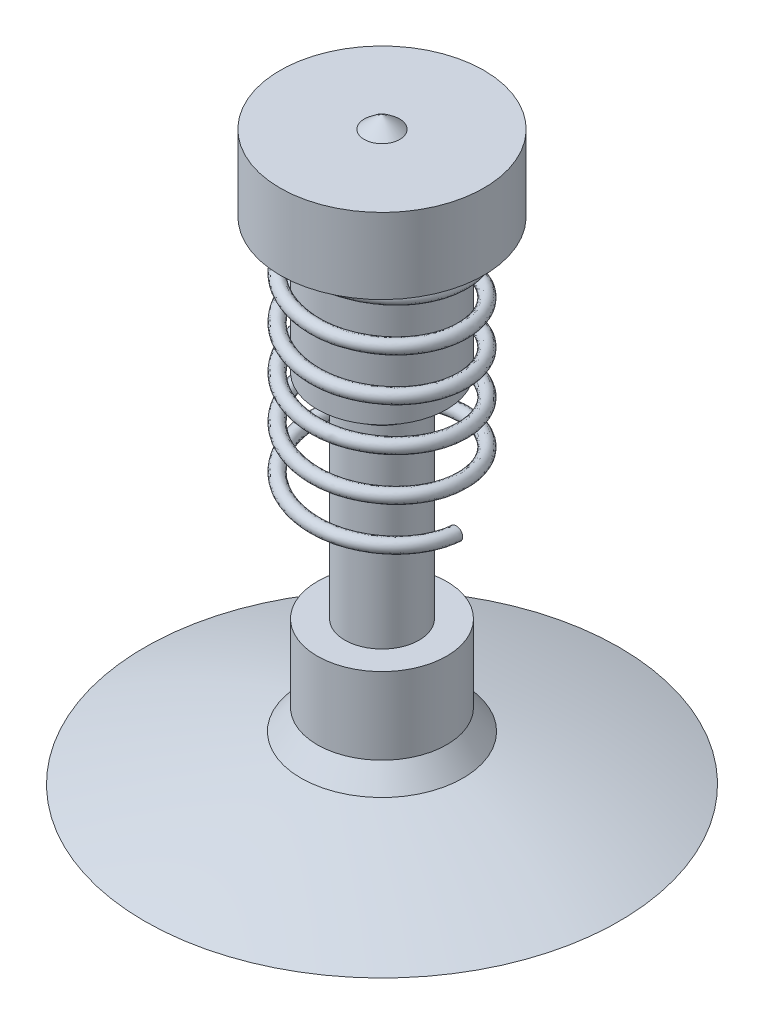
from build123d import *

# Parameters (mm, degrees)
SWEEP_1_PITCH       = 0.2
SWEEP_1_HEIGHT      = 1.1
SWEEP_1_RADIUS      = 0.344
SWEEP_1_START_ANGLE = -90
SKETCH_3_R          = 0.03


with BuildPart() as part:
    # Sketch 1 → Revolve 1 (revolve)
    with BuildSketch(Plane.XY, mode=Mode.PRIVATE) as revolve_1_sk:
        with BuildLine():
            Line((0, 2.69), (0, 0))
            Line((0, 0), (1.1, 0))
            ThreePointArc((1.1, 0), (0.741670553, 0.119223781), (0.375716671, 0.212454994))
            Line((0.375716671, 0.212454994), (0.3, 0.308617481))
            Line((0.3, 0.308617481), (0.3, 0.664482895))
            Line((0.3, 0.664482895), (0.172, 0.664482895))
            Line((0.172, 0.664482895), (0.172, 1.562203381))
            Line((0.172, 1.562203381), (0.3, 1.655))
            Line((0.3, 1.655), (0.3, 2.28))
            Line((0.3, 2.28), (0.472614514, 2.28))
            Line((0.472614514, 2.28), (0.472614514, 2.63))
            Line((0.472614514, 2.63), (0.082366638, 2.63))
            ThreePointArc((0.082366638, 2.63), (0.04232221, 2.661563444), (0, 2.69))
        make_face()
    revolve(revolve_1_sk.sketch.rotate(Axis((0, 2.69, 0), (0, -1, 0)), 90), axis=Axis((0, 2.69, 0), (0, -1, 0)))

    # Sweep 1: sweep along a helix
    with BuildLine() as sweep_1_path:
        add(Helix(SWEEP_1_PITCH, SWEEP_1_HEIGHT, SWEEP_1_RADIUS, center=(0, 2.28, 0), direction=(0, -1, 0), lefthand=True, mode=Mode.PRIVATE).rotate(Axis((0, 2.28, 0), (0, -1, 0)), SWEEP_1_START_ANGLE))
    # Sketch 3 → Sweep 1 (sweep)
    with BuildSketch(Plane.XY):
        with Locations((0.344, 2.18)):
            Circle(SKETCH_3_R)
    sweep(path=sweep_1_path.line, is_frenet=True)


solid = part.part
